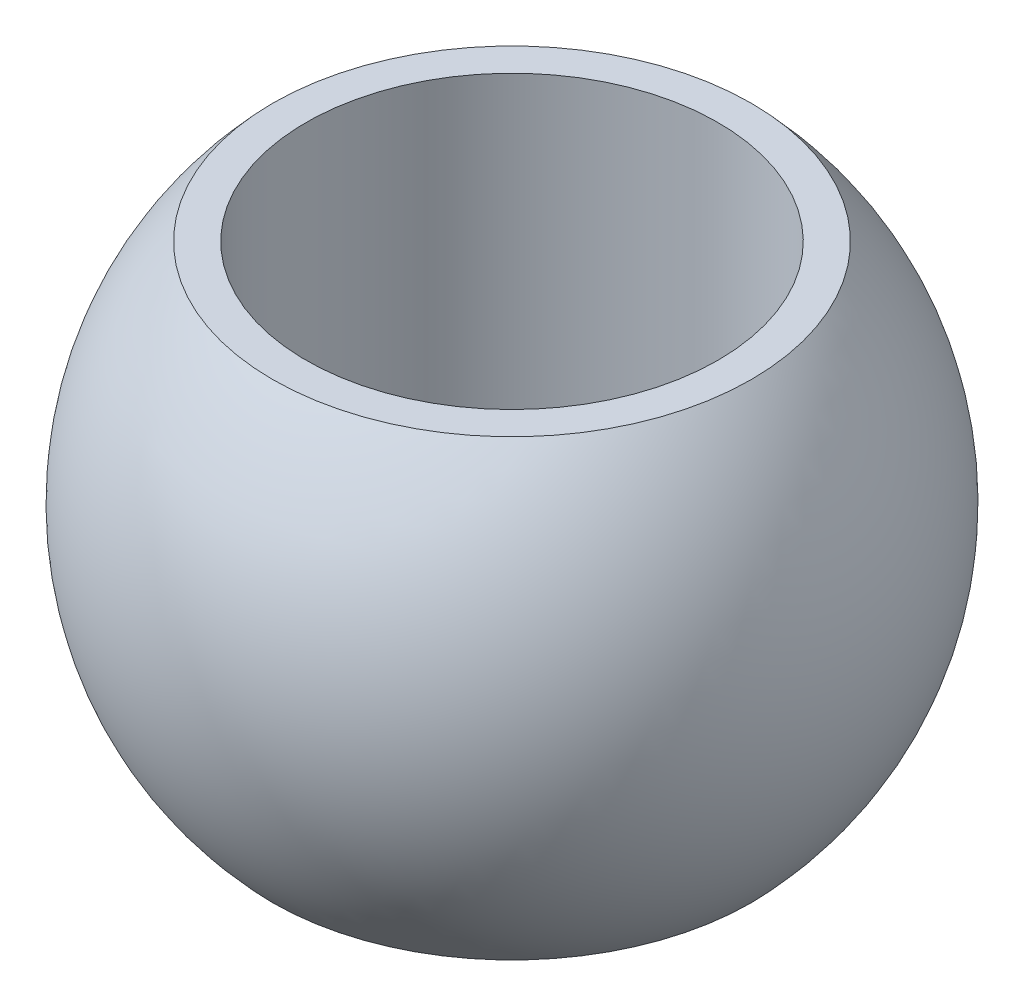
from build123d import *


with BuildPart() as part:
    # Sketch1 → Revolve1 (revolve)
    with BuildSketch(Plane.XY):
        with BuildLine():
            Line((-25, 27.5), (-25, -27.5))
            Line((-25, -27.5), (-29.047375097, -27.5))
            ThreePointArc((-29.047375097, -27.5), (-40, 0), (-29.047375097, 27.5))
            Line((-29.047375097, 27.5), (-25, 27.5))
        make_face()
    revolve(axis=Axis((0, -27.5, 0), (0, 1, 0)))


solid = part.part
